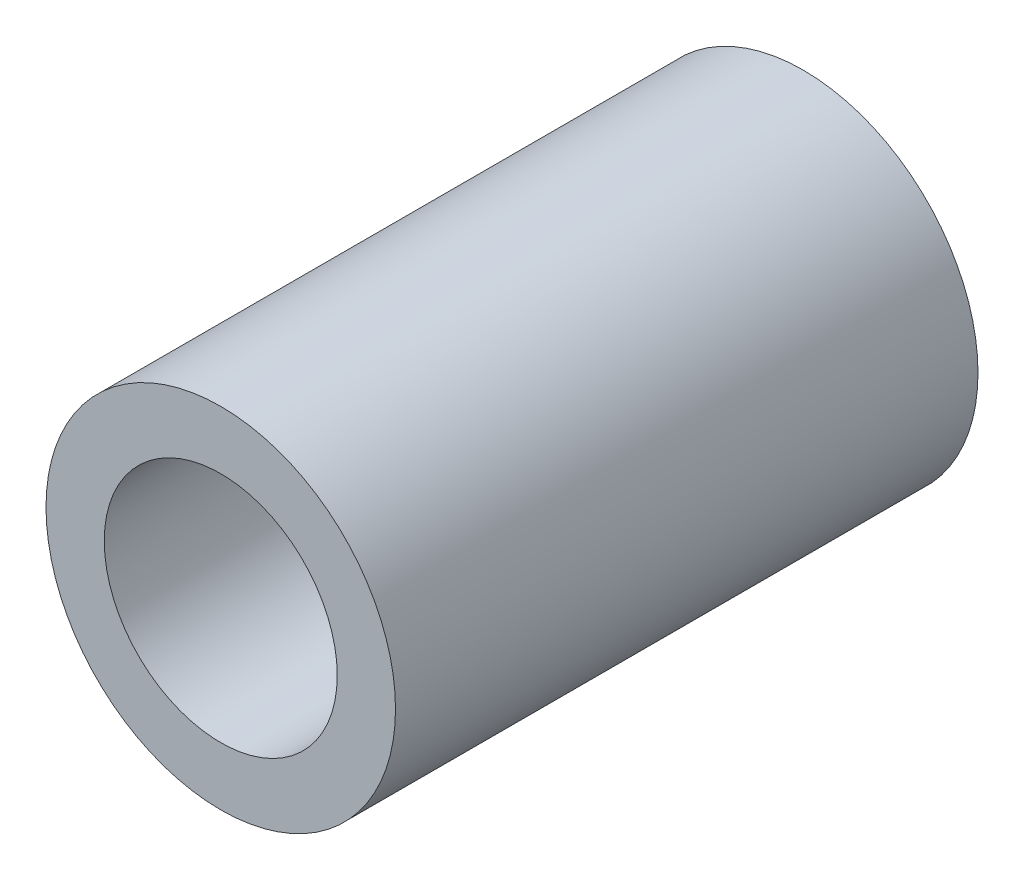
from build123d import *

# Parameters (mm, degrees)
ESQUISSE1_R             = 30
EXTRUSION1_DEPTH        = 100
ESQUISSE2_R             = 20
ENL_V_MAT_EXTRU_2_DEPTH = 109.627804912


with BuildPart() as part:
    # Esquisse1 → Extrusion1 (new body)
    with BuildSketch(Plane.XY):
        Circle(ESQUISSE1_R)
    extrude(amount=EXTRUSION1_DEPTH)

    # Esquisse2 → Enl_v. mat.-Extru.2 (cut, through all)
    with BuildSketch(Plane.XY):
        Circle(ESQUISSE2_R)
    extrude(amount=ENL_V_MAT_EXTRU_2_DEPTH, mode=Mode.SUBTRACT)


solid = part.part
